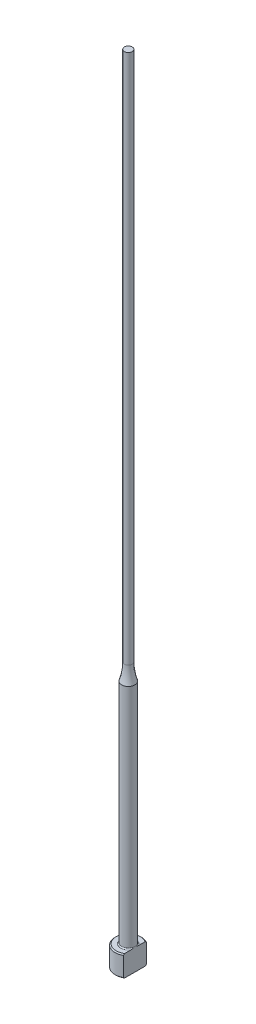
ISO-10303-21;
HEADER;
FILE_DESCRIPTION(('STEP AP214'),'2;1');
FILE_NAME('part.step','',(''),(''),'','','');
FILE_SCHEMA(('AUTOMOTIVE_DESIGN { 1 0 10303 214 1 1 1 1 }'));
ENDSEC;
DATA;
#1=APPLICATION_CONTEXT('core data for automotive mechanical design processes');
#2=APPLICATION_PROTOCOL_DEFINITION('international standard','automotive_design',2000,#1);
#3=PRODUCT_CONTEXT('',#1,'mechanical');
#4=PRODUCT('Part','Part','',(#3));
#5=PRODUCT_RELATED_PRODUCT_CATEGORY('part','',(#4));
#6=PRODUCT_DEFINITION_FORMATION('','',#4);
#7=PRODUCT_DEFINITION_CONTEXT('part definition',#1,'design');
#8=PRODUCT_DEFINITION('design','',#6,#7);
#9=PRODUCT_DEFINITION_SHAPE('','',#8);
#10=(LENGTH_UNIT() NAMED_UNIT(*) SI_UNIT(.MILLI.,.METRE.));
#11=(NAMED_UNIT(*) PLANE_ANGLE_UNIT() SI_UNIT($,.RADIAN.));
#12=(NAMED_UNIT(*) SI_UNIT($,.STERADIAN.) SOLID_ANGLE_UNIT());
#13=UNCERTAINTY_MEASURE_WITH_UNIT(LENGTH_MEASURE(1.E-05),#10,'distance_accuracy_value','');
#14=(GEOMETRIC_REPRESENTATION_CONTEXT(3) GLOBAL_UNCERTAINTY_ASSIGNED_CONTEXT((#13)) GLOBAL_UNIT_ASSIGNED_CONTEXT((#10,
#11,#12)) REPRESENTATION_CONTEXT('',''));
#15=CARTESIAN_POINT('',(0.,0.,0.));
#16=DIRECTION('',(0.,0.,1.));
#17=DIRECTION('',(1.,0.,0.));
#18=AXIS2_PLACEMENT_3D('',#15,#16,#17);
#19=CARTESIAN_POINT('',(-2.49999999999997,4.,0.));
#20=DIRECTION('',(0.,1.,0.));
#21=DIRECTION('',(0.,0.,1.));
#22=AXIS2_PLACEMENT_3D('',#19,#20,#21);
#23=PLANE('',#22);
#24=CARTESIAN_POINT('',(0.,4.,0.));
#25=DIRECTION('',(0.,1.,0.));
#26=DIRECTION('',(0.,0.,1.));
#27=AXIS2_PLACEMENT_3D('',#24,#25,#26);
#28=CIRCLE('',#27,2.29999999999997);
#29=CARTESIAN_POINT('',(1.24999999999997,4.,-1.93067345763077));
#30=VERTEX_POINT('',#29);
#31=CARTESIAN_POINT('',(1.24999999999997,4.,1.93067345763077));
#32=VERTEX_POINT('',#31);
#33=EDGE_CURVE('E187',#30,#32,#28,.T.);
#34=ORIENTED_EDGE('',*,*,#33,.T.);
#35=DIRECTION('',(0.,0.,-1.));
#36=VECTOR('',#35,1.);
#37=CARTESIAN_POINT('',(1.24999999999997,4.,0.));
#38=LINE('',#37,#36);
#39=CARTESIAN_POINT('',(1.24999999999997,3.99999999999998,0.734846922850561));
#40=VERTEX_POINT('',#39);
#41=EDGE_CURVE('E57',#32,#40,#38,.T.);
#42=ORIENTED_EDGE('',*,*,#41,.T.);
#43=CARTESIAN_POINT('',(0.,4.,0.));
#44=DIRECTION('',(0.,1.,0.));
#45=DIRECTION('',(0.,0.,1.));
#46=AXIS2_PLACEMENT_3D('',#43,#44,#45);
#47=CIRCLE('',#46,1.44999999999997);
#48=CARTESIAN_POINT('',(1.24999999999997,3.99999999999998,-0.734846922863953));
#49=VERTEX_POINT('',#48);
#50=EDGE_CURVE('E108',#40,#49,#47,.F.);
#51=ORIENTED_EDGE('',*,*,#50,.T.);
#52=EDGE_CURVE('E137',#49,#30,#38,.T.);
#53=ORIENTED_EDGE('',*,*,#52,.T.);
#54=EDGE_LOOP('',(#34,#42,#51,#53));
#55=FACE_BOUND('',#54,.T.);
#56=ADVANCED_FACE('F32',(#55),#23,.T.);
#57=CARTESIAN_POINT('',(0.,259.958771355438,0.));
#58=DIRECTION('',(0.,1.,0.));
#59=DIRECTION('',(0.,0.,1.));
#60=AXIS2_PLACEMENT_3D('',#57,#58,#59);
#61=CYLINDRICAL_SURFACE('',#60,2.49999999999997);
#62=CARTESIAN_POINT('',(0.,3.80000000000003,0.));
#63=DIRECTION('',(0.,1.,0.));
#64=DIRECTION('',(0.,0.,1.));
#65=AXIS2_PLACEMENT_3D('',#62,#63,#64);
#66=CIRCLE('',#65,2.49999999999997);
#67=CARTESIAN_POINT('',(1.24999999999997,3.80000000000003,2.16506350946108));
#68=VERTEX_POINT('',#67);
#69=CARTESIAN_POINT('',(1.24999999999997,3.80000000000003,-2.16506350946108));
#70=VERTEX_POINT('',#69);
#71=EDGE_CURVE('E105',#68,#70,#66,.F.);
#72=ORIENTED_EDGE('',*,*,#71,.T.);
#73=DIRECTION('',(0.,-1.,0.));
#74=VECTOR('',#73,1.);
#75=CARTESIAN_POINT('',(1.24999999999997,150.,-2.16506350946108));
#76=LINE('',#75,#74);
#77=CARTESIAN_POINT('',(1.24999999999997,0.199999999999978,-2.16506350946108));
#78=VERTEX_POINT('',#77);
#79=EDGE_CURVE('E193',#70,#78,#76,.T.);
#80=ORIENTED_EDGE('',*,*,#79,.T.);
#81=CARTESIAN_POINT('',(0.,0.199999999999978,0.));
#82=DIRECTION('',(0.,-1.,0.));
#83=DIRECTION('',(0.,0.,-1.));
#84=AXIS2_PLACEMENT_3D('',#81,#82,#83);
#85=CIRCLE('',#84,2.49999999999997);
#86=CARTESIAN_POINT('',(1.24999999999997,0.199999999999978,2.16506350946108));
#87=VERTEX_POINT('',#86);
#88=EDGE_CURVE('E100',#78,#87,#85,.F.);
#89=ORIENTED_EDGE('',*,*,#88,.T.);
#90=DIRECTION('',(0.,-1.,0.));
#91=VECTOR('',#90,1.);
#92=CARTESIAN_POINT('',(1.24999999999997,150.,2.16506350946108));
#93=LINE('',#92,#91);
#94=EDGE_CURVE('E93',#68,#87,#93,.T.);
#95=ORIENTED_EDGE('',*,*,#94,.F.);
#96=EDGE_LOOP('',(#72,#80,#89,#95));
#97=FACE_BOUND('',#96,.T.);
#98=ADVANCED_FACE('F158',(#97),#61,.T.);
#99=CARTESIAN_POINT('',(0.,0.,0.));
#100=DIRECTION('',(0.,-1.,0.));
#101=DIRECTION('',(0.,0.,-1.));
#102=AXIS2_PLACEMENT_3D('',#99,#100,#101);
#103=PLANE('',#102);
#104=CARTESIAN_POINT('',(0.,0.,0.));
#105=DIRECTION('',(0.,-1.,0.));
#106=DIRECTION('',(0.,0.,-1.));
#107=AXIS2_PLACEMENT_3D('',#104,#105,#106);
#108=CIRCLE('',#107,2.29999999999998);
#109=CARTESIAN_POINT('',(1.24999999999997,0.,1.93067345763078));
#110=VERTEX_POINT('',#109);
#111=CARTESIAN_POINT('',(1.24999999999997,0.,-1.93067345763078));
#112=VERTEX_POINT('',#111);
#113=EDGE_CURVE('E98',#110,#112,#108,.T.);
#114=ORIENTED_EDGE('',*,*,#113,.T.);
#115=DIRECTION('',(0.,0.,1.));
#116=VECTOR('',#115,1.);
#117=CARTESIAN_POINT('',(1.24999999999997,0.,2.16506350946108));
#118=LINE('',#117,#116);
#119=EDGE_CURVE('E83',#112,#110,#118,.T.);
#120=ORIENTED_EDGE('',*,*,#119,.T.);
#121=EDGE_LOOP('',(#114,#120));
#122=FACE_BOUND('',#121,.T.);
#123=ADVANCED_FACE('F103',(#122),#103,.T.);
#124=CARTESIAN_POINT('',(0.,4.,0.));
#125=DIRECTION('',(0.,-1.,0.));
#126=DIRECTION('',(0.,0.,-1.));
#127=AXIS2_PLACEMENT_3D('',#124,#125,#126);
#128=CONICAL_SURFACE('',#127,2.29999999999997,0.785398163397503);
#129=ORIENTED_EDGE('',*,*,#71,.F.);
#130=CARTESIAN_POINT('',(1.24999999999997,1.37269850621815,4.76610952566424));
#131=CARTESIAN_POINT('',(1.24999999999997,1.47721375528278,4.65805337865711));
#132=CARTESIAN_POINT('',(1.24999999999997,1.5816168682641,4.54988840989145));
#133=CARTESIAN_POINT('',(1.24999999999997,1.79013244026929,4.33327605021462));
#134=CARTESIAN_POINT('',(1.24999999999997,1.89424489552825,4.22482865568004));
#135=CARTESIAN_POINT('',(1.24999999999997,2.10216338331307,4.0075337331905));
#136=CARTESIAN_POINT('',(1.24999999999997,2.20596923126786,3.89868602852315));
#137=CARTESIAN_POINT('',(1.24999999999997,2.4131219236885,3.68055575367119));
#138=CARTESIAN_POINT('',(1.24999999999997,2.51646877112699,3.57127318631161));
#139=CARTESIAN_POINT('',(1.24999999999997,2.72052253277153,3.35432408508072));
#140=CARTESIAN_POINT('',(1.24999999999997,2.82124112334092,3.24666854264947));
#141=CARTESIAN_POINT('',(1.24999999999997,3.02192410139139,3.03065701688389));
#142=CARTESIAN_POINT('',(1.24999999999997,3.12188849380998,2.92230103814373));
#143=CARTESIAN_POINT('',(1.24999999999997,3.32077037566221,2.70467415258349));
#144=CARTESIAN_POINT('',(1.24999999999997,3.41968808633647,2.59540344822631));
#145=CARTESIAN_POINT('',(1.24999999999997,3.61608273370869,2.37557697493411));
#146=CARTESIAN_POINT('',(1.24999999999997,3.71355972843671,2.26502125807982));
#147=CARTESIAN_POINT('',(1.24999999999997,3.86911393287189,2.08515617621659));
#148=CARTESIAN_POINT('',(1.24999999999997,3.9278559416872,2.01642247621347));
#149=CARTESIAN_POINT('',(1.24999999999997,4.04429378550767,1.87806056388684));
#150=CARTESIAN_POINT('',(1.24999999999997,4.1019895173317,1.80843226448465));
#151=CARTESIAN_POINT('',(1.24999999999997,4.21658041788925,1.66728976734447));
#152=CARTESIAN_POINT('',(1.24999999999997,4.27346067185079,1.59576341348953));
#153=CARTESIAN_POINT('',(1.24999999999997,4.38522965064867,1.45118948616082));
#154=CARTESIAN_POINT('',(1.24999999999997,4.44011885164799,1.37814228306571));
#155=CARTESIAN_POINT('',(1.24999999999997,4.54788773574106,1.22886697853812));
#156=CARTESIAN_POINT('',(1.24999999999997,4.60072420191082,1.1526074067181));
#157=CARTESIAN_POINT('',(1.24999999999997,4.70212030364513,0.997098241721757));
#158=CARTESIAN_POINT('',(1.24999999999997,4.75067405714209,0.917844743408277));
#159=CARTESIAN_POINT('',(1.24999999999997,4.84043729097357,0.756494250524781));
#160=CARTESIAN_POINT('',(1.24999999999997,4.88173033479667,0.674444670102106));
#161=CARTESIAN_POINT('',(1.24999999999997,4.95366083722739,0.50583597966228));
#162=CARTESIAN_POINT('',(1.24999999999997,4.98433405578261,0.419293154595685));
#163=CARTESIAN_POINT('',(1.24999999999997,5.01753107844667,0.28950787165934));
#164=CARTESIAN_POINT('',(1.24999999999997,5.02633539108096,0.247870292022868));
#165=CARTESIAN_POINT('',(1.24999999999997,5.03997448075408,0.163937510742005));
#166=CARTESIAN_POINT('',(1.24999999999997,5.04480960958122,0.121642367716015));
#167=CARTESIAN_POINT('',(1.24999999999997,5.05016786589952,0.0369068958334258));
#168=CARTESIAN_POINT('',(1.24999999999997,5.05070431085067,-0.00553257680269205));
#169=CARTESIAN_POINT('',(1.24999999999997,5.04746162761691,-0.0902467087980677));
#170=CARTESIAN_POINT('',(1.24999999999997,5.04368214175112,-0.132521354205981));
#171=CARTESIAN_POINT('',(1.24999999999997,5.03212264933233,-0.216135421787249));
#172=CARTESIAN_POINT('',(1.24999999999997,5.02437758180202,-0.257479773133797));
#173=CARTESIAN_POINT('',(1.24999999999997,5.00536735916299,-0.339354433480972));
#174=CARTESIAN_POINT('',(1.24999999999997,4.99410082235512,-0.379884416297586));
#175=CARTESIAN_POINT('',(1.24999999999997,4.96852211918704,-0.460209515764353));
#176=CARTESIAN_POINT('',(1.24999999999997,4.95419322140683,-0.499999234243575));
#177=CARTESIAN_POINT('',(1.24999999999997,4.92306392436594,-0.578577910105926));
#178=CARTESIAN_POINT('',(1.24999999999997,4.90626403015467,-0.617367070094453));
#179=CARTESIAN_POINT('',(1.24999999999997,4.85269034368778,-0.73271994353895));
#180=CARTESIAN_POINT('',(1.24999999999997,4.81287978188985,-0.807869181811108));
#181=CARTESIAN_POINT('',(1.24999999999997,4.7279921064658,-0.955157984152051));
#182=CARTESIAN_POINT('',(1.24999999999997,4.68290855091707,-1.02729371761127));
#183=CARTESIAN_POINT('',(1.24999999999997,4.58903993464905,-1.16950551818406));
#184=CARTESIAN_POINT('',(1.24999999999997,4.54024093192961,-1.2395723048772));
#185=CARTESIAN_POINT('',(1.24999999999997,4.4402182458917,-1.37788366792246));
#186=CARTESIAN_POINT('',(1.24999999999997,4.38899576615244,-1.44612912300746));
#187=CARTESIAN_POINT('',(1.24999999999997,4.28411092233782,-1.58215279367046));
#188=CARTESIAN_POINT('',(1.24999999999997,4.23042529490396,-1.64991298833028));
#189=CARTESIAN_POINT('',(1.24999999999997,4.12172412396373,-1.78436052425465));
#190=CARTESIAN_POINT('',(1.24999999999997,4.06670849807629,-1.85104779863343));
#191=CARTESIAN_POINT('',(1.24999999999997,3.90044437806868,-2.04954410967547));
#192=CARTESIAN_POINT('',(1.24999999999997,3.78772044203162,-2.18011527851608));
#193=CARTESIAN_POINT('',(1.24999999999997,3.57927088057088,-2.41711311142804));
#194=CARTESIAN_POINT('',(1.24999999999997,3.48391557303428,-2.52386864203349));
#195=CARTESIAN_POINT('',(1.24999999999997,3.2920293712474,-2.73632311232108));
#196=CARTESIAN_POINT('',(1.24999999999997,3.19549844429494,-2.84202202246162));
#197=CARTESIAN_POINT('',(1.24999999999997,2.90446939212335,-3.15815976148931));
#198=CARTESIAN_POINT('',(1.24999999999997,2.70871394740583,-3.36743889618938));
#199=CARTESIAN_POINT('',(1.24999999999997,2.32338273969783,-3.77561196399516));
#200=CARTESIAN_POINT('',(1.24999999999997,2.13388401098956,-3.97457897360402));
#201=CARTESIAN_POINT('',(1.24999999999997,1.84887947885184,-4.27209258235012));
#202=CARTESIAN_POINT('',(1.24999999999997,1.75380504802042,-4.37105278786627));
#203=CARTESIAN_POINT('',(1.24999999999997,1.56341833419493,-4.56874260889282));
#204=CARTESIAN_POINT('',(1.24999999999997,1.46810605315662,-4.66747222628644));
#205=CARTESIAN_POINT('',(1.24999999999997,1.37269850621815,-4.76610952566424));
#206=B_SPLINE_CURVE_WITH_KNOTS('',3,(#130,#131,#132,#133,#134,#135,#136,#137,#138,#139,#140,
#141,#142,#143,#144,#145,#146,#147,#148,#149,#150,#151,#152,#153,#154,#155,#156,#157,#158,#159,
#160,#161,#162,#163,#164,#165,#166,#167,#168,#169,#170,#171,#172,#173,#174,#175,#176,#177,#178,
#179,#180,#181,#182,#183,#184,#185,#186,#187,#188,#189,#190,#191,#192,#193,#194,#195,#196,#197,
#198,#199,#200,#201,#202,#203,#204,#205),.UNSPECIFIED.,.F.,.F.,(4,2,2,2,2,2,2,2,2,2,2,2,2,2,2,2,
2,2,2,2,2,2,2,2,2,2,2,2,2,2,2,2,2,2,2,2,2,4),(0.,0.450994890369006,0.901995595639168,
1.35322763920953,1.80445675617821,2.24672733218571,2.68899501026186,3.13116725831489,
3.57332164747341,3.84456018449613,4.11582532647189,4.3899586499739,4.66402597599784,
4.94225842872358,5.22086725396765,5.49602313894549,5.77024327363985,5.8977564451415,
6.02525831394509,6.15236502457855,6.2794822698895,6.40549833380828,6.5315639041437,
6.65833670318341,6.78508362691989,7.03983854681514,7.29490801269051,7.55098686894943,
7.80693985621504,8.06626716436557,8.32561057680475,8.84304654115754,9.27246240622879,
9.7018902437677,10.5615524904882,11.3858525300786,11.797544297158,12.2092326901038),.UNSPECIFIED.);
#207=EDGE_CURVE('E136',#68,#32,#206,.T.);
#208=ORIENTED_EDGE('',*,*,#207,.T.);
#209=ORIENTED_EDGE('',*,*,#33,.F.);
#210=EDGE_CURVE('E128',#30,#70,#206,.T.);
#211=ORIENTED_EDGE('',*,*,#210,.T.);
#212=EDGE_LOOP('',(#129,#208,#209,#211));
#213=FACE_BOUND('',#212,.T.);
#214=ADVANCED_FACE('F144',(#213),#128,.T.);
#215=CARTESIAN_POINT('',(0.,0.199999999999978,0.));
#216=DIRECTION('',(0.,1.,0.));
#217=DIRECTION('',(0.,0.,1.));
#218=AXIS2_PLACEMENT_3D('',#215,#216,#217);
#219=CONICAL_SURFACE('',#218,2.49999999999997,0.785398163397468);
#220=ORIENTED_EDGE('',*,*,#88,.F.);
#221=CARTESIAN_POINT('',(1.24999999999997,2.62730149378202,-4.76610952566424));
#222=CARTESIAN_POINT('',(1.24999999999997,2.52278624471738,-4.65805337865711));
#223=CARTESIAN_POINT('',(1.24999999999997,2.41838313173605,-4.54988840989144));
#224=CARTESIAN_POINT('',(1.24999999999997,2.20986755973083,-4.3332760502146));
#225=CARTESIAN_POINT('',(1.24999999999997,2.10575510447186,-4.22482865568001));
#226=CARTESIAN_POINT('',(1.24999999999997,1.89783661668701,-4.00753373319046));
#227=CARTESIAN_POINT('',(1.24999999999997,1.79403076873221,-3.89868602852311));
#228=CARTESIAN_POINT('',(1.24999999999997,1.58687807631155,-3.68055575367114));
#229=CARTESIAN_POINT('',(1.24999999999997,1.48353122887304,-3.57127318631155));
#230=CARTESIAN_POINT('',(1.24999999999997,1.27947746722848,-3.35432408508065));
#231=CARTESIAN_POINT('',(1.24999999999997,1.17875887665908,-3.2466685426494));
#232=CARTESIAN_POINT('',(1.24999999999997,0.978075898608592,-3.0306570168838));
#233=CARTESIAN_POINT('',(1.24999999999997,0.878111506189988,-2.92230103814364));
#234=CARTESIAN_POINT('',(1.24999999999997,0.679229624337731,-2.70467415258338));
#235=CARTESIAN_POINT('',(1.24999999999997,0.580311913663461,-2.5954034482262));
#236=CARTESIAN_POINT('',(1.24999999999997,0.383917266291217,-2.375576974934));
#237=CARTESIAN_POINT('',(1.24999999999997,0.286440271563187,-2.2650212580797));
#238=CARTESIAN_POINT('',(1.24999999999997,0.130886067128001,-2.08515617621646));
#239=CARTESIAN_POINT('',(1.24999999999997,0.0721440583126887,-2.01642247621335));
#240=CARTESIAN_POINT('',(1.24999999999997,-0.044293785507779,-1.87806056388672));
#241=CARTESIAN_POINT('',(1.24999999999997,-0.101989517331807,-1.80843226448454));
#242=CARTESIAN_POINT('',(1.24999999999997,-0.216580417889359,-1.66728976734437));
#243=CARTESIAN_POINT('',(1.24999999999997,-0.273460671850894,-1.59576341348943));
#244=CARTESIAN_POINT('',(1.24999999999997,-0.385229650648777,-1.45118948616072));
#245=CARTESIAN_POINT('',(1.24999999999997,-0.440118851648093,-1.37814228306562));
#246=CARTESIAN_POINT('',(1.24999999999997,-0.547887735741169,-1.22886697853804));
#247=CARTESIAN_POINT('',(1.24999999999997,-0.600724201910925,-1.15260740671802));
#248=CARTESIAN_POINT('',(1.24999999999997,-0.702120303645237,-0.997098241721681));
#249=CARTESIAN_POINT('',(1.24999999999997,-0.750674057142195,-0.917844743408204));
#250=CARTESIAN_POINT('',(1.24999999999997,-0.840437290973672,-0.756494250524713));
#251=CARTESIAN_POINT('',(1.24999999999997,-0.88173033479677,-0.67444467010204));
#252=CARTESIAN_POINT('',(1.24999999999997,-0.953660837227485,-0.505835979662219));
#253=CARTESIAN_POINT('',(1.24999999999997,-0.984334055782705,-0.419293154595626));
#254=CARTESIAN_POINT('',(1.24999999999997,-1.01753107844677,-0.289507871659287));
#255=CARTESIAN_POINT('',(1.24999999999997,-1.02633539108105,-0.247870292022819));
#256=CARTESIAN_POINT('',(1.24999999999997,-1.03997448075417,-0.163937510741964));
#257=CARTESIAN_POINT('',(1.24999999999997,-1.0448096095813,-0.121642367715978));
#258=CARTESIAN_POINT('',(1.24999999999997,-1.05016786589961,-0.0369068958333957));
#259=CARTESIAN_POINT('',(1.24999999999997,-1.05070431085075,0.00553257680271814));
#260=CARTESIAN_POINT('',(1.24999999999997,-1.04746162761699,0.0902467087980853));
#261=CARTESIAN_POINT('',(1.24999999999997,-1.0436821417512,0.132521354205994));
#262=CARTESIAN_POINT('',(1.24999999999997,-1.03212264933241,0.216135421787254));
#263=CARTESIAN_POINT('',(1.24999999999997,-1.0243775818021,0.257479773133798));
#264=CARTESIAN_POINT('',(1.24999999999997,-1.00536735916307,0.339354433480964));
#265=CARTESIAN_POINT('',(1.24999999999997,-0.994100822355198,0.379884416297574));
#266=CARTESIAN_POINT('',(1.24999999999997,-0.968522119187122,0.460209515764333));
#267=CARTESIAN_POINT('',(1.24999999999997,-0.954193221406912,0.499999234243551));
#268=CARTESIAN_POINT('',(1.24999999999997,-0.923063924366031,0.578577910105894));
#269=CARTESIAN_POINT('',(1.24999999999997,-0.906264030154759,0.617367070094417));
#270=CARTESIAN_POINT('',(1.24999999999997,-0.852690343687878,0.732719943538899));
#271=CARTESIAN_POINT('',(1.24999999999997,-0.812879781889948,0.807869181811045));
#272=CARTESIAN_POINT('',(1.24999999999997,-0.727992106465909,0.955157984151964));
#273=CARTESIAN_POINT('',(1.24999999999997,-0.682908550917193,1.02729371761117));
#274=CARTESIAN_POINT('',(1.24999999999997,-0.589039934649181,1.16950551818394));
#275=CARTESIAN_POINT('',(1.24999999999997,-0.54024093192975,1.23957230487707));
#276=CARTESIAN_POINT('',(1.24999999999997,-0.440218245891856,1.3778836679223));
#277=CARTESIAN_POINT('',(1.24999999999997,-0.388995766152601,1.44612912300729));
#278=CARTESIAN_POINT('',(1.24999999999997,-0.284110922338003,1.58215279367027));
#279=CARTESIAN_POINT('',(1.24999999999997,-0.230425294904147,1.64991298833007));
#280=CARTESIAN_POINT('',(1.24999999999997,-0.121724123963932,1.78436052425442));
#281=CARTESIAN_POINT('',(1.24999999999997,-0.0667084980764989,1.8510477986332));
#282=CARTESIAN_POINT('',(1.24999999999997,0.0995556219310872,2.0495441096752));
#283=CARTESIAN_POINT('',(1.24999999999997,0.212279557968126,2.18011527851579));
#284=CARTESIAN_POINT('',(1.24999999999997,0.420729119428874,2.41711311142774));
#285=CARTESIAN_POINT('',(1.24999999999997,0.516084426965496,2.5238686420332));
#286=CARTESIAN_POINT('',(1.24999999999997,0.707970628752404,2.73632311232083));
#287=CARTESIAN_POINT('',(1.24999999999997,0.804501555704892,2.84202202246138));
#288=CARTESIAN_POINT('',(1.24999999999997,1.09553060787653,3.15815976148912));
#289=CARTESIAN_POINT('',(1.24999999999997,1.29128605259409,3.36743889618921));
#290=CARTESIAN_POINT('',(1.24999999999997,1.67661726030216,3.77561196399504));
#291=CARTESIAN_POINT('',(1.24999999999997,1.86611598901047,3.97457897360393));
#292=CARTESIAN_POINT('',(1.24999999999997,2.15112052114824,4.27209258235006));
#293=CARTESIAN_POINT('',(1.24999999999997,2.24619495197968,4.37105278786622));
#294=CARTESIAN_POINT('',(1.24999999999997,2.43658166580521,4.5687426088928));
#295=CARTESIAN_POINT('',(1.24999999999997,2.53189394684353,4.66747222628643));
#296=CARTESIAN_POINT('',(1.24999999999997,2.62730149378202,4.76610952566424));
#297=B_SPLINE_CURVE_WITH_KNOTS('',3,(#221,#222,#223,#224,#225,#226,#227,#228,#229,#230,#231,
#232,#233,#234,#235,#236,#237,#238,#239,#240,#241,#242,#243,#244,#245,#246,#247,#248,#249,#250,
#251,#252,#253,#254,#255,#256,#257,#258,#259,#260,#261,#262,#263,#264,#265,#266,#267,#268,#269,
#270,#271,#272,#273,#274,#275,#276,#277,#278,#279,#280,#281,#282,#283,#284,#285,#286,#287,#288,
#289,#290,#291,#292,#293,#294,#295,#296),.UNSPECIFIED.,.F.,.F.,(4,2,2,2,2,2,2,2,2,2,2,2,2,2,2,2,
2,2,2,2,2,2,2,2,2,2,2,2,2,2,2,2,2,2,2,2,2,4),(0.,0.450994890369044,0.901995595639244,
1.35322763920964,1.80445675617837,2.2467273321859,2.68899501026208,3.13116725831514,
3.57332164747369,3.84456018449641,4.11582532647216,4.38995864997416,4.6640259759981,
4.94225842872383,5.22086725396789,5.49602313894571,5.77024327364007,5.89775644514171,
6.02525831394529,6.15236502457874,6.27948226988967,6.40549833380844,6.53156390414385,
6.65833670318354,6.78508362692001,7.03983854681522,7.29490801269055,7.55098686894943,
7.806939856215,8.06626716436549,8.32561057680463,8.84304654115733,9.27246240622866,
9.70189024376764,10.5615524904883,11.3858525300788,11.7975442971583,12.2092326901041),.UNSPECIFIED.);
#298=EDGE_CURVE('E86',#78,#112,#297,.T.);
#299=ORIENTED_EDGE('',*,*,#298,.T.);
#300=ORIENTED_EDGE('',*,*,#113,.F.);
#301=EDGE_CURVE('E89',#110,#87,#297,.T.);
#302=ORIENTED_EDGE('',*,*,#301,.T.);
#303=EDGE_LOOP('',(#220,#299,#300,#302));
#304=FACE_BOUND('',#303,.T.);
#305=ADVANCED_FACE('F97',(#304),#219,.T.);
#306=CARTESIAN_POINT('',(0.,4.19999999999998,0.));
#307=DIRECTION('',(0.,1.,0.));
#308=DIRECTION('',(0.,0.,1.));
#309=AXIS2_PLACEMENT_3D('',#306,#307,#308);
#310=TOROIDAL_SURFACE('',#309,1.44999999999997,0.2);
#311=CARTESIAN_POINT('',(1.24999999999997,4.19999999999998,0.));
#312=CARTESIAN_POINT('',(1.24999999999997,4.20000051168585,-1.97682160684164E-10));
#313=CARTESIAN_POINT('',(1.24999999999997,4.20000102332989,-1.08908071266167E-07));
#314=CARTESIAN_POINT('',(1.24999999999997,4.20000200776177,-4.52594777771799E-07));
#315=CARTESIAN_POINT('',(1.24999999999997,4.20000247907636,-6.9099305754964E-07));
#316=CARTESIAN_POINT('',(1.24999999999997,4.20000341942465,-1.26357946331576E-06));
#317=CARTESIAN_POINT('',(1.24999999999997,4.20000388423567,-1.60457621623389E-06));
#318=CARTESIAN_POINT('',(1.24999999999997,4.20000476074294,-2.33954904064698E-06));
#319=CARTESIAN_POINT('',(1.24999999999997,4.2000051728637,-2.73304152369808E-06));
#320=CARTESIAN_POINT('',(1.24999999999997,4.20000655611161,-4.14544018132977E-06));
#321=CARTESIAN_POINT('',(1.24999999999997,4.20000745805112,-5.23310098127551E-06));
#322=CARTESIAN_POINT('',(1.24999999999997,4.20000906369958,-7.47950368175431E-06));
#323=CARTESIAN_POINT('',(1.24999999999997,4.20000977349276,-8.63414445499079E-06));
#324=CARTESIAN_POINT('',(1.24999999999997,4.20001244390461,-1.31453477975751E-05));
#325=CARTESIAN_POINT('',(1.24999999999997,4.20001426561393,-1.65880556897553E-05));
#326=CARTESIAN_POINT('',(1.24999999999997,4.20001724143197,-2.33729030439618E-05));
#327=CARTESIAN_POINT('',(1.24999999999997,4.20001844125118,-2.66956155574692E-05));
#328=CARTESIAN_POINT('',(1.24999999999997,4.20002354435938,-4.08635087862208E-05));
#329=CARTESIAN_POINT('',(1.24999999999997,4.20002741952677,-5.17114616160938E-05));
#330=CARTESIAN_POINT('',(1.24999999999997,4.20003363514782,-7.2005767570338E-05));
#331=CARTESIAN_POINT('',(1.24999999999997,4.20003612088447,-8.14057067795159E-05));
#332=CARTESIAN_POINT('',(1.24999999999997,4.20005581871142,-0.000149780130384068));
#333=CARTESIAN_POINT('',(1.24999999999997,4.20008094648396,-0.00020612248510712));
#334=CARTESIAN_POINT('',(1.24999999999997,4.20017507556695,-0.000425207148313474));
#335=CARTESIAN_POINT('',(1.24999999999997,4.20023819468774,-0.000589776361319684));
#336=CARTESIAN_POINT('',(1.24999999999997,4.20048692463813,-0.00122878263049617));
#337=CARTESIAN_POINT('',(1.24999999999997,4.20067870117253,-0.00170134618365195));
#338=CARTESIAN_POINT('',(1.24999999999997,4.2014602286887,-0.00363636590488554));
#339=CARTESIAN_POINT('',(1.24999999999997,4.20204298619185,-0.00510090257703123));
#340=CARTESIAN_POINT('',(1.24999999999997,4.20939719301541,-0.0235712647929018));
#341=CARTESIAN_POINT('',(1.24999999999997,4.21621259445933,-0.0405643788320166));
#342=CARTESIAN_POINT('',(1.24999999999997,4.22951000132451,-0.0739606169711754));
#343=CARTESIAN_POINT('',(1.24999999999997,4.23599508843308,-0.0903626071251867));
#344=CARTESIAN_POINT('',(1.24999999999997,4.24961430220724,-0.125111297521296));
#345=CARTESIAN_POINT('',(1.24999999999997,4.2567364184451,-0.1434628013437));
#346=CARTESIAN_POINT('',(1.24999999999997,4.27085039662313,-0.180427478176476));
#347=CARTESIAN_POINT('',(1.24999999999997,4.27784022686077,-0.199041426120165));
#348=CARTESIAN_POINT('',(1.24999999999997,4.29479134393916,-0.245221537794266));
#349=CARTESIAN_POINT('',(1.24999999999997,4.30459026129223,-0.272848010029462));
#350=CARTESIAN_POINT('',(1.24999999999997,4.32310234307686,-0.327738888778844));
#351=CARTESIAN_POINT('',(1.24999999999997,4.3318356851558,-0.354996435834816));
#352=CARTESIAN_POINT('',(1.24999999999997,4.3493656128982,-0.413744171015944));
#353=CARTESIAN_POINT('',(1.24999999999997,4.35799470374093,-0.44528522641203));
#354=CARTESIAN_POINT('',(1.24999999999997,4.37338463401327,-0.50909191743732));
#355=CARTESIAN_POINT('',(1.24999999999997,4.38013036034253,-0.541361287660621));
#356=CARTESIAN_POINT('',(1.24999999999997,4.39136059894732,-0.608339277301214));
#357=CARTESIAN_POINT('',(1.24999999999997,4.39568167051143,-0.643076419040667));
#358=CARTESIAN_POINT('',(1.24999999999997,4.40037605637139,-0.712733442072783));
#359=CARTESIAN_POINT('',(1.24999999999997,4.40076553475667,-0.747651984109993));
#360=CARTESIAN_POINT('',(1.24999999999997,4.39677668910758,-0.808103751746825));
#361=CARTESIAN_POINT('',(1.24999999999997,4.39361441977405,-0.833711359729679));
#362=CARTESIAN_POINT('',(1.24999999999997,4.38355990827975,-0.883915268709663));
#363=CARTESIAN_POINT('',(1.24999999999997,4.37671813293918,-0.908520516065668));
#364=CARTESIAN_POINT('',(1.24999999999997,4.36252570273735,-0.944879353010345));
#365=CARTESIAN_POINT('',(1.24999999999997,4.35688428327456,-0.957298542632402));
#366=CARTESIAN_POINT('',(1.24999999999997,4.34399066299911,-0.981318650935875));
#367=CARTESIAN_POINT('',(1.24999999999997,4.33673636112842,-0.992918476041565));
#368=CARTESIAN_POINT('',(1.24999999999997,4.32199744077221,-1.01267533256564));
#369=CARTESIAN_POINT('',(1.24999999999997,4.31482723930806,-1.02106482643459));
#370=CARTESIAN_POINT('',(1.24999999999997,4.29924321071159,-1.03659690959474));
#371=CARTESIAN_POINT('',(1.24999999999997,4.29083198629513,-1.04374204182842));
#372=CARTESIAN_POINT('',(1.24999999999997,4.27498600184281,-1.05478694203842));
#373=CARTESIAN_POINT('',(1.24999999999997,4.26780814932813,-1.059053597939));
#374=CARTESIAN_POINT('',(1.24999999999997,4.25284782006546,-1.06635953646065));
#375=CARTESIAN_POINT('',(1.24999999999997,4.24506572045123,-1.06939957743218));
#376=CARTESIAN_POINT('',(1.24999999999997,4.22901828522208,-1.07404931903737));
#377=CARTESIAN_POINT('',(1.24999999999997,4.22074990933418,-1.07564870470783));
#378=CARTESIAN_POINT('',(1.24999999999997,4.20405985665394,-1.07723717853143));
#379=CARTESIAN_POINT('',(1.24999999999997,4.19563825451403,-1.07722703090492));
#380=CARTESIAN_POINT('',(1.24999999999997,4.17988128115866,-1.07569157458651));
#381=CARTESIAN_POINT('',(1.24999999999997,4.17252879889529,-1.0743339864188));
#382=CARTESIAN_POINT('',(1.24999999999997,4.15814333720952,-1.07044616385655));
#383=CARTESIAN_POINT('',(1.24999999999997,4.15111040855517,-1.06791574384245));
#384=CARTESIAN_POINT('',(1.24999999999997,4.13724955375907,-1.06171920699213));
#385=CARTESIAN_POINT('',(1.24999999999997,4.13043935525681,-1.05801386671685));
#386=CARTESIAN_POINT('',(1.24999999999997,4.11740316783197,-1.04969609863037));
#387=CARTESIAN_POINT('',(1.24999999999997,4.11117742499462,-1.04508329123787));
#388=CARTESIAN_POINT('',(1.24999999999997,4.0958619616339,-1.03220341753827));
#389=CARTESIAN_POINT('',(1.24999999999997,4.08723799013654,-1.02338140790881));
#390=CARTESIAN_POINT('',(1.24999999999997,4.07148817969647,-1.00448021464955));
#391=CARTESIAN_POINT('',(1.24999999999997,4.06436716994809,-0.994397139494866));
#392=CARTESIAN_POINT('',(1.24999999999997,4.04800089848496,-0.96769446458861));
#393=CARTESIAN_POINT('',(1.24999999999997,4.0397014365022,-0.950498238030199));
#394=CARTESIAN_POINT('',(1.24999999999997,4.02582422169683,-0.915117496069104));
#395=CARTESIAN_POINT('',(1.24999999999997,4.02024415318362,-0.89693383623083));
#396=CARTESIAN_POINT('',(1.24999999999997,4.00805724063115,-0.846781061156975));
#397=CARTESIAN_POINT('',(1.24999999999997,4.00359525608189,-0.814297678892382));
#398=CARTESIAN_POINT('',(1.24999999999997,3.99933348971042,-0.748574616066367));
#399=CARTESIAN_POINT('',(1.24999999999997,3.99961552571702,-0.71533156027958));
#400=CARTESIAN_POINT('',(1.24999999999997,4.00446632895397,-0.637920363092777));
#401=CARTESIAN_POINT('',(1.24999999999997,4.0104488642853,-0.593849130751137));
#402=CARTESIAN_POINT('',(1.24999999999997,4.02681929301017,-0.50640159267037));
#403=CARTESIAN_POINT('',(1.24999999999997,4.03722697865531,-0.463029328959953));
#404=CARTESIAN_POINT('',(1.24999999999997,4.060071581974,-0.380638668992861));
#405=CARTESIAN_POINT('',(1.24999999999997,4.07227412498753,-0.34155342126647));
#406=CARTESIAN_POINT('',(1.24999999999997,4.09824323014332,-0.264347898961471));
#407=CARTESIAN_POINT('',(1.24999999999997,4.11199311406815,-0.226221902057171));
#408=CARTESIAN_POINT('',(1.24999999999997,4.13108825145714,-0.175350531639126));
#409=CARTESIAN_POINT('',(1.24999999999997,4.13599999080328,-0.162438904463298));
#410=CARTESIAN_POINT('',(1.24999999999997,4.14604281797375,-0.136318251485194));
#411=CARTESIAN_POINT('',(1.24999999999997,4.15117629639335,-0.123110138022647));
#412=CARTESIAN_POINT('',(1.24999999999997,4.16341702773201,-0.0918425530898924));
#413=CARTESIAN_POINT('',(1.24999999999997,4.17055250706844,-0.0737943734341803));
#414=CARTESIAN_POINT('',(1.24999999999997,4.18426943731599,-0.0393586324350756));
#415=CARTESIAN_POINT('',(1.24999999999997,4.19084281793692,-0.0229681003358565));
#416=CARTESIAN_POINT('',(1.24999999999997,4.19795564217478,-0.00510438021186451));
#417=CARTESIAN_POINT('',(1.24999999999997,4.19853702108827,-0.00364331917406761));
#418=CARTESIAN_POINT('',(1.24999999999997,4.19931818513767,-0.00170914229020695));
#419=CARTESIAN_POINT('',(1.24999999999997,4.19951102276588,-0.00123396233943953));
#420=CARTESIAN_POINT('',(1.24999999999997,4.19976104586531,-0.000591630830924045));
#421=CARTESIAN_POINT('',(1.24999999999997,4.19982443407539,-0.000426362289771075));
#422=CARTESIAN_POINT('',(1.24999999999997,4.19991892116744,-0.000206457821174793));
#423=CARTESIAN_POINT('',(1.24999999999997,4.19994410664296,-0.000149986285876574));
#424=CARTESIAN_POINT('',(1.24999999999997,4.19996383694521,-8.14647488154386E-05));
#425=CARTESIAN_POINT('',(1.24999999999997,4.19996632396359,-7.20551568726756E-05));
#426=CARTESIAN_POINT('',(1.24999999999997,4.19997254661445,-5.17396177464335E-05));
#427=CARTESIAN_POINT('',(1.24999999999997,4.19997642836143,-4.08803463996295E-05));
#428=CARTESIAN_POINT('',(1.24999999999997,4.19998153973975,-2.66997573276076E-05));
#429=CARTESIAN_POINT('',(1.24999999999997,4.19998274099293,-2.33755457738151E-05));
#430=CARTESIAN_POINT('',(1.24999999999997,4.1999857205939,-1.65878758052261E-05));
#431=CARTESIAN_POINT('',(1.24999999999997,4.19998754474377,-1.31438994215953E-05));
#432=CARTESIAN_POINT('',(1.24999999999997,4.19999021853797,-8.63150511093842E-06));
#433=CARTESIAN_POINT('',(1.24999999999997,4.19999092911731,-7.47674880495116E-06));
#434=CARTESIAN_POINT('',(1.24999999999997,4.19999253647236,-5.23027080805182E-06));
#435=CARTESIAN_POINT('',(1.24999999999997,4.19999343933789,-4.14265821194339E-06));
#436=CARTESIAN_POINT('',(1.24999999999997,4.19999482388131,-2.73051190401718E-06));
#437=CARTESIAN_POINT('',(1.24999999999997,4.19999523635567,-2.33712918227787E-06));
#438=CARTESIAN_POINT('',(1.24999999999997,4.1999961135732,-1.60243917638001E-06));
#439=CARTESIAN_POINT('',(1.24999999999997,4.19999657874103,-1.26161620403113E-06));
#440=CARTESIAN_POINT('',(1.24999999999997,4.19999751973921,-6.89449589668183E-07));
#441=CARTESIAN_POINT('',(1.24999999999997,4.1999979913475,-4.51288695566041E-07));
#442=CARTESIAN_POINT('',(1.24999999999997,4.19999897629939,-1.08178106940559E-07));
#443=CARTESIAN_POINT('',(1.24999999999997,4.19999948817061,1.97737602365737E-10));
#444=CARTESIAN_POINT('',(1.24999999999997,4.19999999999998,0.));
#445=B_SPLINE_CURVE_WITH_KNOTS('',3,(#311,#312,#313,#314,#315,#316,#317,#318,#319,#320,#321,
#322,#323,#324,#325,#326,#327,#328,#329,#330,#331,#332,#333,#334,#335,#336,#337,#338,#339,#340,
#341,#342,#343,#344,#345,#346,#347,#348,#349,#350,#351,#352,#353,#354,#355,#356,#357,#358,#359,
#360,#361,#362,#363,#364,#365,#366,#367,#368,#369,#370,#371,#372,#373,#374,#375,#376,#377,#378,
#379,#380,#381,#382,#383,#384,#385,#386,#387,#388,#389,#390,#391,#392,#393,#394,#395,#396,#397,
#398,#399,#400,#401,#402,#403,#404,#405,#406,#407,#408,#409,#410,#411,#412,#413,#414,#415,#416,
#417,#418,#419,#420,#421,#422,#423,#424,#425,#426,#427,#428,#429,#430,#431,#432,#433,#434,#435,
#436,#437,#438,#439,#440,#441,#442,#443,#444),.UNSPECIFIED.,.T.,.F.,(4,2,2,2,2,2,2,2,2,2,2,2,2,
2,2,2,2,2,2,2,2,2,2,2,2,2,2,2,2,2,2,2,2,2,2,2,2,2,2,2,2,2,2,2,2,2,2,2,2,2,2,2,2,2,2,2,2,2,2,2,2,
2,2,2,2,2,4),(0.,1.53427571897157E-06,3.11115051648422E-06,4.83351630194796E-06,
6.54098938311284E-06,1.07594292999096E-05,1.48222850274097E-05,2.64707312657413E-05,
3.70576286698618E-05,7.16088725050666E-05,0.000100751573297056,0.000285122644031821,
0.00081447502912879,0.00234373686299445,0.00707317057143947,0.0619940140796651,
0.114907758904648,0.17396170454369,0.233609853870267,0.321537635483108,0.40738870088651,
0.505443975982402,0.604264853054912,0.709126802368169,0.813557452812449,0.890773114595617,
0.966955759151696,1.00778845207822,1.04867465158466,1.08167318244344,1.11460346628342,
1.13955805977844,1.16449720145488,1.1896135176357,1.2147179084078,1.23704542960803,
1.25937648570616,1.28254952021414,1.30573226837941,1.34253218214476,1.37944859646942,
1.43640829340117,1.49331940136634,1.59113685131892,1.69064301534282,1.82371118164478,
1.9573808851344,2.08016146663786,2.20172662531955,2.2431696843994,2.28568093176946,
2.34390494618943,2.39687801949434,2.40159623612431,2.40313396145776,2.40366556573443,
2.40385035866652,2.40387953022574,2.403914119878,2.40392471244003,2.403936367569,
2.4039404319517,2.40394465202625,2.40394636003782,2.403948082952,2.40394966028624,
2.40395119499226),.UNSPECIFIED.);
#446=CARTESIAN_POINT('',(1.24999999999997,4.19999999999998,0.));
#447=VERTEX_POINT('',#446);
#448=EDGE_CURVE('E11',#49,#447,#445,.T.);
#449=ORIENTED_EDGE('',*,*,#448,.F.);
#450=ORIENTED_EDGE('',*,*,#50,.F.);
#451=CARTESIAN_POINT('',(1.24999999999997,4.19999999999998,0.));
#452=CARTESIAN_POINT('',(1.24999999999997,4.19999948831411,1.9768217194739E-10));
#453=CARTESIAN_POINT('',(1.24999999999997,4.19999897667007,1.08908071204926E-07));
#454=CARTESIAN_POINT('',(1.24999999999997,4.19999799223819,4.52594777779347E-07));
#455=CARTESIAN_POINT('',(1.24999999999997,4.19999752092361,6.9099305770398E-07));
#456=CARTESIAN_POINT('',(1.24999999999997,4.19999658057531,1.26357946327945E-06));
#457=CARTESIAN_POINT('',(1.24999999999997,4.19999611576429,1.6045762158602E-06));
#458=CARTESIAN_POINT('',(1.24999999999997,4.19999523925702,2.33954904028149E-06));
#459=CARTESIAN_POINT('',(1.24999999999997,4.19999482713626,2.73304152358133E-06));
#460=CARTESIAN_POINT('',(1.24999999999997,4.19999344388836,4.14544018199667E-06));
#461=CARTESIAN_POINT('',(1.24999999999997,4.19999254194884,5.23310098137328E-06));
#462=CARTESIAN_POINT('',(1.24999999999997,4.19999093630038,7.47950368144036E-06));
#463=CARTESIAN_POINT('',(1.24999999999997,4.19999022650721,8.63414445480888E-06));
#464=CARTESIAN_POINT('',(1.24999999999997,4.19998755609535,1.31453477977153E-05));
#465=CARTESIAN_POINT('',(1.24999999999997,4.19998573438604,1.65880556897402E-05));
#466=CARTESIAN_POINT('',(1.24999999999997,4.19998275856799,2.33729030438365E-05));
#467=CARTESIAN_POINT('',(1.24999999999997,4.19998155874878,2.66956155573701E-05));
#468=CARTESIAN_POINT('',(1.24999999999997,4.19997645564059,4.0863508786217E-05));
#469=CARTESIAN_POINT('',(1.24999999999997,4.1999725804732,5.17114616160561E-05));
#470=CARTESIAN_POINT('',(1.24999999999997,4.19996636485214,7.20057675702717E-05));
#471=CARTESIAN_POINT('',(1.24999999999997,4.19996387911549,8.1405706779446E-05));
#472=CARTESIAN_POINT('',(1.24999999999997,4.19994418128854,0.000149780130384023));
#473=CARTESIAN_POINT('',(1.24999999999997,4.199919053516,0.000206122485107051));
#474=CARTESIAN_POINT('',(1.24999999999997,4.19982492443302,0.000425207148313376));
#475=CARTESIAN_POINT('',(1.24999999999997,4.19976180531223,0.000589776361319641));
#476=CARTESIAN_POINT('',(1.24999999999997,4.19951307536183,0.00122878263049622));
#477=CARTESIAN_POINT('',(1.24999999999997,4.19932129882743,0.00170134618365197));
#478=CARTESIAN_POINT('',(1.24999999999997,4.19853977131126,0.00363636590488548));
#479=CARTESIAN_POINT('',(1.24999999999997,4.19795701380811,0.0051009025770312));
#480=CARTESIAN_POINT('',(1.24999999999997,4.19060280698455,0.0235712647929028));
#481=CARTESIAN_POINT('',(1.24999999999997,4.18378740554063,0.0405643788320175));
#482=CARTESIAN_POINT('',(1.24999999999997,4.17048999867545,0.073960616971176));
#483=CARTESIAN_POINT('',(1.24999999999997,4.16400491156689,0.0903626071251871));
#484=CARTESIAN_POINT('',(1.24999999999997,4.15038569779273,0.125111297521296));
#485=CARTESIAN_POINT('',(1.24999999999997,4.14326358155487,0.1434628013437));
#486=CARTESIAN_POINT('',(1.24999999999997,4.12914960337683,0.180427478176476));
#487=CARTESIAN_POINT('',(1.24999999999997,4.12215977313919,0.199041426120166));
#488=CARTESIAN_POINT('',(1.24999999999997,4.1052086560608,0.245221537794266));
#489=CARTESIAN_POINT('',(1.24999999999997,4.09540973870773,0.272848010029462));
#490=CARTESIAN_POINT('',(1.24999999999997,4.0768976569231,0.327738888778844));
#491=CARTESIAN_POINT('',(1.24999999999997,4.06816431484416,0.354996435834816));
#492=CARTESIAN_POINT('',(1.24999999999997,4.05063438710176,0.413744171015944));
#493=CARTESIAN_POINT('',(1.24999999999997,4.04200529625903,0.44528522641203));
#494=CARTESIAN_POINT('',(1.24999999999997,4.0266153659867,0.50909191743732));
#495=CARTESIAN_POINT('',(1.24999999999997,4.01986963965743,0.541361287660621));
#496=CARTESIAN_POINT('',(1.24999999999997,4.00863940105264,0.608339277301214));
#497=CARTESIAN_POINT('',(1.24999999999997,4.00431832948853,0.643076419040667));
#498=CARTESIAN_POINT('',(1.24999999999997,3.99962394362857,0.712733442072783));
#499=CARTESIAN_POINT('',(1.24999999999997,3.99923446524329,0.747651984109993));
#500=CARTESIAN_POINT('',(1.24999999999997,4.00322331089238,0.808103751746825));
#501=CARTESIAN_POINT('',(1.24999999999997,4.00638558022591,0.833711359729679));
#502=CARTESIAN_POINT('',(1.24999999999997,4.01644009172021,0.883915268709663));
#503=CARTESIAN_POINT('',(1.24999999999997,4.02328186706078,0.908520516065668));
#504=CARTESIAN_POINT('',(1.24999999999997,4.03747429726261,0.944879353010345));
#505=CARTESIAN_POINT('',(1.24999999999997,4.0431157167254,0.957298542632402));
#506=CARTESIAN_POINT('',(1.24999999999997,4.05600933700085,0.981318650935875));
#507=CARTESIAN_POINT('',(1.24999999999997,4.06326363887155,0.992918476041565));
#508=CARTESIAN_POINT('',(1.24999999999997,4.07800255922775,1.01267533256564));
#509=CARTESIAN_POINT('',(1.24999999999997,4.08517276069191,1.02106482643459));
#510=CARTESIAN_POINT('',(1.24999999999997,4.10075678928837,1.03659690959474));
#511=CARTESIAN_POINT('',(1.24999999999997,4.10916801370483,1.04374204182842));
#512=CARTESIAN_POINT('',(1.24999999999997,4.12501399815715,1.05478694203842));
#513=CARTESIAN_POINT('',(1.24999999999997,4.13219185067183,1.059053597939));
#514=CARTESIAN_POINT('',(1.24999999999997,4.1471521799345,1.06635953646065));
#515=CARTESIAN_POINT('',(1.24999999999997,4.15493427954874,1.06939957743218));
#516=CARTESIAN_POINT('',(1.24999999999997,4.17098171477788,1.07404931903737));
#517=CARTESIAN_POINT('',(1.24999999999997,4.17925009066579,1.07564870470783));
#518=CARTESIAN_POINT('',(1.24999999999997,4.19594014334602,1.07723717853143));
#519=CARTESIAN_POINT('',(1.24999999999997,4.20436174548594,1.07722703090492));
#520=CARTESIAN_POINT('',(1.24999999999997,4.2201187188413,1.07569157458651));
#521=CARTESIAN_POINT('',(1.24999999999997,4.22747120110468,1.0743339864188));
#522=CARTESIAN_POINT('',(1.24999999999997,4.24185666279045,1.07044616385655));
#523=CARTESIAN_POINT('',(1.24999999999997,4.2488895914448,1.06791574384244));
#524=CARTESIAN_POINT('',(1.24999999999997,4.2627504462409,1.06171920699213));
#525=CARTESIAN_POINT('',(1.24999999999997,4.26956064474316,1.05801386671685));
#526=CARTESIAN_POINT('',(1.24999999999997,4.28259683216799,1.04969609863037));
#527=CARTESIAN_POINT('',(1.24999999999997,4.28882257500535,1.04508329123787));
#528=CARTESIAN_POINT('',(1.24999999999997,4.30413803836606,1.03220341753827));
#529=CARTESIAN_POINT('',(1.24999999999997,4.31276200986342,1.02338140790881));
#530=CARTESIAN_POINT('',(1.24999999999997,4.32851182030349,1.00448021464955));
#531=CARTESIAN_POINT('',(1.24999999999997,4.33563283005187,0.994397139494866));
#532=CARTESIAN_POINT('',(1.24999999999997,4.351999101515,0.96769446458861));
#533=CARTESIAN_POINT('',(1.24999999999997,4.36029856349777,0.9504982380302));
#534=CARTESIAN_POINT('',(1.24999999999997,4.37417577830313,0.915117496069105));
#535=CARTESIAN_POINT('',(1.24999999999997,4.37975584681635,0.89693383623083));
#536=CARTESIAN_POINT('',(1.24999999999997,4.39194275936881,0.846781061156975));
#537=CARTESIAN_POINT('',(1.24999999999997,4.39640474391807,0.814297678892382));
#538=CARTESIAN_POINT('',(1.24999999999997,4.40066651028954,0.748574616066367));
#539=CARTESIAN_POINT('',(1.24999999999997,4.40038447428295,0.71533156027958));
#540=CARTESIAN_POINT('',(1.24999999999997,4.39553367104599,0.637920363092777));
#541=CARTESIAN_POINT('',(1.24999999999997,4.38955113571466,0.593849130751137));
#542=CARTESIAN_POINT('',(1.24999999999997,4.37318070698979,0.50640159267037));
#543=CARTESIAN_POINT('',(1.24999999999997,4.36277302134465,0.463029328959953));
#544=CARTESIAN_POINT('',(1.24999999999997,4.33992841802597,0.380638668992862));
#545=CARTESIAN_POINT('',(1.24999999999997,4.32772587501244,0.34155342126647));
#546=CARTESIAN_POINT('',(1.24999999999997,4.30175676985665,0.264347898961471));
#547=CARTESIAN_POINT('',(1.24999999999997,4.28800688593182,0.226221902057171));
#548=CARTESIAN_POINT('',(1.24999999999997,4.26891174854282,0.175350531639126));
#549=CARTESIAN_POINT('',(1.24999999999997,4.26400000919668,0.162438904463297));
#550=CARTESIAN_POINT('',(1.24999999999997,4.25395718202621,0.136318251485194));
#551=CARTESIAN_POINT('',(1.24999999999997,4.24882370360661,0.123110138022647));
#552=CARTESIAN_POINT('',(1.24999999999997,4.23658297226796,0.0918425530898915));
#553=CARTESIAN_POINT('',(1.24999999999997,4.22944749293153,0.0737943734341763));
#554=CARTESIAN_POINT('',(1.24999999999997,4.21573056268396,0.0393586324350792));
#555=CARTESIAN_POINT('',(1.24999999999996,4.209157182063,0.0229681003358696));
#556=CARTESIAN_POINT('',(1.24999999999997,4.20204435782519,0.00510438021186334));
#557=CARTESIAN_POINT('',(1.24999999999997,4.2014629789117,0.0036433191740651));
#558=CARTESIAN_POINT('',(1.24999999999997,4.20068181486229,0.00170914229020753));
#559=CARTESIAN_POINT('',(1.24999999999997,4.20048897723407,0.00123396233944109));
#560=CARTESIAN_POINT('',(1.24999999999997,4.20023895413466,0.00059163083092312));
#561=CARTESIAN_POINT('',(1.24999999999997,4.20017556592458,0.000426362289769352));
#562=CARTESIAN_POINT('',(1.24999999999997,4.20008107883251,0.000206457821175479));
#563=CARTESIAN_POINT('',(1.24999999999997,4.20005589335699,0.000149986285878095));
#564=CARTESIAN_POINT('',(1.24999999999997,4.20003616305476,8.14647488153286E-05));
#565=CARTESIAN_POINT('',(1.24999999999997,4.20003367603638,7.2055156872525E-05));
#566=CARTESIAN_POINT('',(1.24999999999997,4.20002745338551,5.17396177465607E-05));
#567=CARTESIAN_POINT('',(1.24999999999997,4.20002357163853,4.08803464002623E-05));
#568=CARTESIAN_POINT('',(1.24999999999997,4.20001846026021,2.66997573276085E-05));
#569=CARTESIAN_POINT('',(1.24999999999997,4.20001725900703,2.33755457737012E-05));
#570=CARTESIAN_POINT('',(1.24999999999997,4.20001427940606,1.65878758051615E-05));
#571=CARTESIAN_POINT('',(1.24999999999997,4.20001245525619,1.314389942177E-05));
#572=CARTESIAN_POINT('',(1.24999999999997,4.20000978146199,8.63150511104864E-06));
#573=CARTESIAN_POINT('',(1.24999999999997,4.20000907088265,7.47674880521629E-06));
#574=CARTESIAN_POINT('',(1.24999999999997,4.2000074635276,5.23027080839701E-06));
#575=CARTESIAN_POINT('',(1.24999999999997,4.20000656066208,4.14265821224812E-06));
#576=CARTESIAN_POINT('',(1.24999999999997,4.20000517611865,2.73051190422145E-06));
#577=CARTESIAN_POINT('',(1.24999999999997,4.20000476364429,2.33712918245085E-06));
#578=CARTESIAN_POINT('',(1.24999999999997,4.20000388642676,1.60243917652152E-06));
#579=CARTESIAN_POINT('',(1.24999999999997,4.20000342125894,1.2616162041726E-06));
#580=CARTESIAN_POINT('',(1.24999999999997,4.20000248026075,6.89449589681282E-07));
#581=CARTESIAN_POINT('',(1.24999999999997,4.20000200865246,4.51288695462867E-07));
#582=CARTESIAN_POINT('',(1.24999999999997,4.20000102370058,1.08178106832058E-07));
#583=CARTESIAN_POINT('',(1.24999999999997,4.20000051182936,-1.97737613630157E-10));
#584=CARTESIAN_POINT('',(1.24999999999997,4.19999999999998,0.));
#585=B_SPLINE_CURVE_WITH_KNOTS('',3,(#451,#452,#453,#454,#455,#456,#457,#458,#459,#460,#461,
#462,#463,#464,#465,#466,#467,#468,#469,#470,#471,#472,#473,#474,#475,#476,#477,#478,#479,#480,
#481,#482,#483,#484,#485,#486,#487,#488,#489,#490,#491,#492,#493,#494,#495,#496,#497,#498,#499,
#500,#501,#502,#503,#504,#505,#506,#507,#508,#509,#510,#511,#512,#513,#514,#515,#516,#517,#518,
#519,#520,#521,#522,#523,#524,#525,#526,#527,#528,#529,#530,#531,#532,#533,#534,#535,#536,#537,
#538,#539,#540,#541,#542,#543,#544,#545,#546,#547,#548,#549,#550,#551,#552,#553,#554,#555,#556,
#557,#558,#559,#560,#561,#562,#563,#564,#565,#566,#567,#568,#569,#570,#571,#572,#573,#574,#575,
#576,#577,#578,#579,#580,#581,#582,#583,#584),.UNSPECIFIED.,.T.,.F.,(4,2,2,2,2,2,2,2,2,2,2,2,2,
2,2,2,2,2,2,2,2,2,2,2,2,2,2,2,2,2,2,2,2,2,2,2,2,2,2,2,2,2,2,2,2,2,2,2,2,2,2,2,2,2,2,2,2,2,2,2,2,
2,2,2,2,2,4),(0.,1.53427571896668E-06,3.11115051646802E-06,4.83351630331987E-06,
6.5409893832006E-06,1.07594292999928E-05,1.4822285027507E-05,2.64707312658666E-05,
3.7057628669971E-05,7.1608872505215E-05,0.000100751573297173,0.00028512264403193,
0.000814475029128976,0.00234373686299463,0.00707317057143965,0.0619940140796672,
0.114907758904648,0.173961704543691,0.233609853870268,0.321537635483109,0.40738870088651,
0.505443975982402,0.604264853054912,0.709126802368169,0.813557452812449,0.890773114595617,
0.966955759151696,1.00778845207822,1.04867465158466,1.08167318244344,1.11460346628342,
1.13955805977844,1.16449720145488,1.1896135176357,1.2147179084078,1.23704542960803,
1.25937648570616,1.28254952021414,1.30573226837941,1.34253218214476,1.37944859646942,
1.43640829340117,1.49331940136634,1.59113685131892,1.69064301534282,1.82371118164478,
1.9573808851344,2.08016146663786,2.20172662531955,2.2431696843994,2.28568093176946,
2.34390494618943,2.39687801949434,2.40159623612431,2.40313396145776,2.40366556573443,
2.40385035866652,2.40387953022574,2.403914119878,2.40392471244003,2.403936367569,
2.4039404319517,2.40394465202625,2.40394636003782,2.40394808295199,2.40394966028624,
2.40395119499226),.UNSPECIFIED.);
#586=EDGE_CURVE('E46',#447,#40,#585,.T.);
#587=ORIENTED_EDGE('',*,*,#586,.F.);
#588=CARTESIAN_POINT('',(0.,4.19999999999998,0.));
#589=DIRECTION('',(0.,1.,0.));
#590=DIRECTION('',(0.,0.,1.));
#591=AXIS2_PLACEMENT_3D('',#588,#589,#590);
#592=CIRCLE('',#591,1.24999999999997);
#593=EDGE_CURVE('E104',#447,#447,#592,.T.);
#594=ORIENTED_EDGE('',*,*,#593,.F.);
#595=EDGE_LOOP('',(#449,#450,#587,#594));
#596=FACE_BOUND('',#595,.T.);
#597=ADVANCED_FACE('F34',(#596),#310,.F.);
#598=CARTESIAN_POINT('',(-0.749999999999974,150.,0.));
#599=DIRECTION('',(0.,1.,0.));
#600=DIRECTION('',(0.,0.,1.));
#601=AXIS2_PLACEMENT_3D('',#598,#599,#600);
#602=PLANE('',#601);
#603=CARTESIAN_POINT('',(0.,150.,0.));
#604=DIRECTION('',(0.,1.,0.));
#605=DIRECTION('',(0.,0.,1.));
#606=AXIS2_PLACEMENT_3D('',#603,#604,#605);
#607=CIRCLE('',#606,0.749999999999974);
#608=CARTESIAN_POINT('',(0.,150.,0.749999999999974));
#609=VERTEX_POINT('',#608);
#610=EDGE_CURVE('E186',#609,#609,#607,.T.);
#611=ORIENTED_EDGE('',*,*,#610,.T.);
#612=EDGE_LOOP('',(#611));
#613=FACE_BOUND('',#612,.T.);
#614=ADVANCED_FACE('F149',(#613),#602,.T.);
#615=CARTESIAN_POINT('',(0.,259.958771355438,0.));
#616=DIRECTION('',(0.,1.,0.));
#617=DIRECTION('',(0.,0.,1.));
#618=AXIS2_PLACEMENT_3D('',#615,#616,#617);
#619=CYLINDRICAL_SURFACE('',#618,0.749999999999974);
#620=CARTESIAN_POINT('',(0.,50.,0.));
#621=DIRECTION('',(0.,1.,0.));
#622=DIRECTION('',(0.,0.,1.));
#623=AXIS2_PLACEMENT_3D('',#620,#621,#622);
#624=CIRCLE('',#623,0.749999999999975);
#625=CARTESIAN_POINT('',(0.,50.,0.749999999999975));
#626=VERTEX_POINT('',#625);
#627=EDGE_CURVE('E183',#626,#626,#624,.T.);
#628=ORIENTED_EDGE('',*,*,#627,.T.);
#629=EDGE_LOOP('',(#628));
#630=FACE_BOUND('',#629,.T.);
#631=ORIENTED_EDGE('',*,*,#610,.F.);
#632=EDGE_LOOP('',(#631));
#633=FACE_BOUND('',#632,.T.);
#634=ADVANCED_FACE('F172',(#630,#633),#619,.T.);
#635=CARTESIAN_POINT('',(0.,50.,0.));
#636=DIRECTION('',(0.,1.,0.));
#637=DIRECTION('',(0.,0.,1.));
#638=AXIS2_PLACEMENT_3D('',#635,#636,#637);
#639=TOROIDAL_SURFACE('',#638,10.75,10.);
#640=CARTESIAN_POINT('',(0.,46.8775010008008,0.));
#641=DIRECTION('',(0.,1.,0.));
#642=DIRECTION('',(0.,0.,1.));
#643=AXIS2_PLACEMENT_3D('',#640,#641,#642);
#644=CIRCLE('',#643,1.24999999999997);
#645=CARTESIAN_POINT('',(0.,46.8775010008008,1.24999999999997));
#646=VERTEX_POINT('',#645);
#647=EDGE_CURVE('E101',#646,#646,#644,.T.);
#648=ORIENTED_EDGE('',*,*,#647,.T.);
#649=EDGE_LOOP('',(#648));
#650=FACE_BOUND('',#649,.T.);
#651=ORIENTED_EDGE('',*,*,#627,.F.);
#652=EDGE_LOOP('',(#651));
#653=FACE_BOUND('',#652,.T.);
#654=ADVANCED_FACE('F169',(#650,#653),#639,.F.);
#655=CARTESIAN_POINT('',(0.,259.958771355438,0.));
#656=DIRECTION('',(0.,1.,0.));
#657=DIRECTION('',(0.,0.,1.));
#658=AXIS2_PLACEMENT_3D('',#655,#656,#657);
#659=CYLINDRICAL_SURFACE('',#658,1.24999999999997);
#660=ORIENTED_EDGE('',*,*,#593,.T.);
#661=EDGE_LOOP('',(#660));
#662=FACE_BOUND('',#661,.T.);
#663=ORIENTED_EDGE('',*,*,#647,.F.);
#664=EDGE_LOOP('',(#663));
#665=FACE_BOUND('',#664,.T.);
#666=ADVANCED_FACE('F122',(#662,#665),#659,.T.);
#667=CARTESIAN_POINT('',(1.24999999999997,150.,2.16506350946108));
#668=DIRECTION('',(1.,0.,0.));
#669=DIRECTION('',(0.,0.,-1.));
#670=AXIS2_PLACEMENT_3D('',#667,#668,#669);
#671=PLANE('',#670);
#672=ORIENTED_EDGE('',*,*,#79,.F.);
#673=ORIENTED_EDGE('',*,*,#210,.F.);
#674=ORIENTED_EDGE('',*,*,#52,.F.);
#675=ORIENTED_EDGE('',*,*,#448,.T.);
#676=ORIENTED_EDGE('',*,*,#586,.T.);
#677=ORIENTED_EDGE('',*,*,#41,.F.);
#678=ORIENTED_EDGE('',*,*,#207,.F.);
#679=ORIENTED_EDGE('',*,*,#94,.T.);
#680=ORIENTED_EDGE('',*,*,#301,.F.);
#681=ORIENTED_EDGE('',*,*,#119,.F.);
#682=ORIENTED_EDGE('',*,*,#298,.F.);
#683=EDGE_LOOP('',(#672,#673,#674,#675,#676,#677,#678,#679,#680,#681,#682));
#684=FACE_BOUND('',#683,.T.);
#685=ADVANCED_FACE('F85',(#684),#671,.T.);
#686=CLOSED_SHELL('',(#56,#98,#123,#214,#305,#597,#614,#634,#654,#666,#685));
#687=MANIFOLD_SOLID_BREP('B2',#686);
#688=ADVANCED_BREP_SHAPE_REPRESENTATION('',(#18,#687),#14);
#689=SHAPE_DEFINITION_REPRESENTATION(#9,#688);
ENDSEC;
END-ISO-10303-21;
